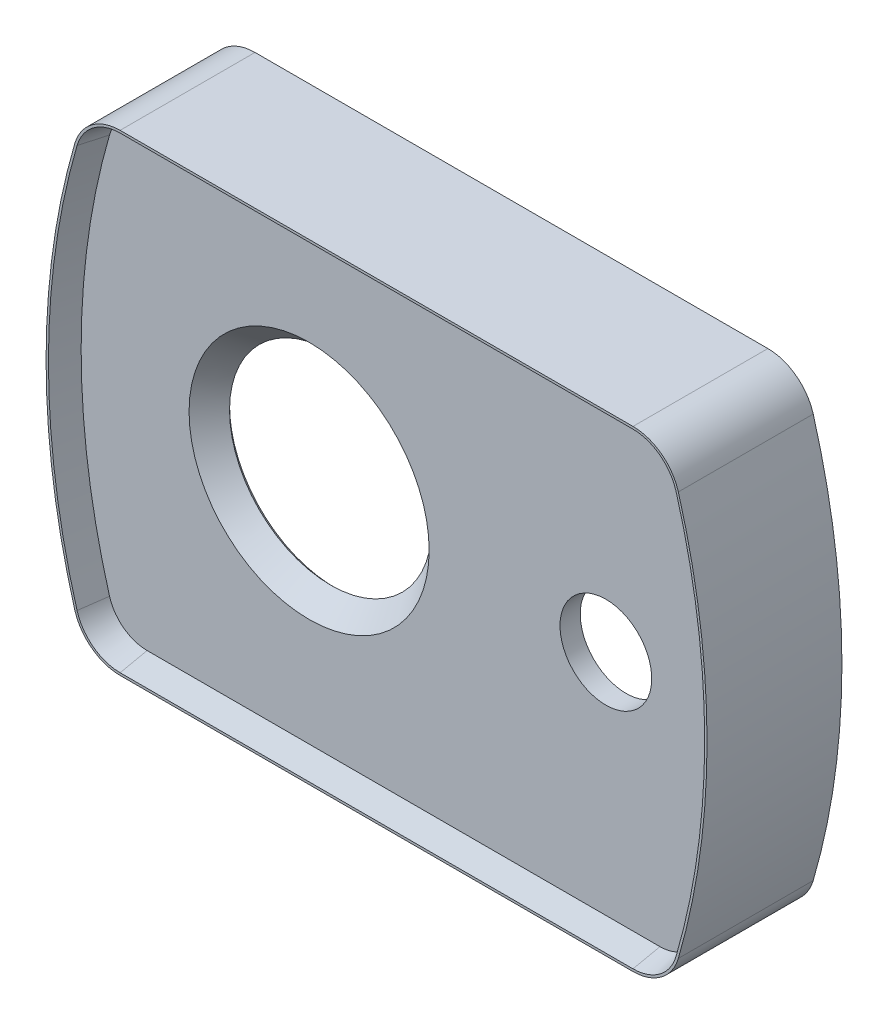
ISO-10303-21;
HEADER;
FILE_DESCRIPTION(('STEP AP214'),'2;1');
FILE_NAME('part.step','',(''),(''),'','','');
FILE_SCHEMA(('AUTOMOTIVE_DESIGN { 1 0 10303 214 1 1 1 1 }'));
ENDSEC;
DATA;
#1=APPLICATION_CONTEXT('core data for automotive mechanical design processes');
#2=APPLICATION_PROTOCOL_DEFINITION('international standard','automotive_design',2000,#1);
#3=PRODUCT_CONTEXT('',#1,'mechanical');
#4=PRODUCT('Part','Part','',(#3));
#5=PRODUCT_RELATED_PRODUCT_CATEGORY('part','',(#4));
#6=PRODUCT_DEFINITION_FORMATION('','',#4);
#7=PRODUCT_DEFINITION_CONTEXT('part definition',#1,'design');
#8=PRODUCT_DEFINITION('design','',#6,#7);
#9=PRODUCT_DEFINITION_SHAPE('','',#8);
#10=(LENGTH_UNIT() NAMED_UNIT(*) SI_UNIT(.MILLI.,.METRE.));
#11=(NAMED_UNIT(*) PLANE_ANGLE_UNIT() SI_UNIT($,.RADIAN.));
#12=(NAMED_UNIT(*) SI_UNIT($,.STERADIAN.) SOLID_ANGLE_UNIT());
#13=UNCERTAINTY_MEASURE_WITH_UNIT(LENGTH_MEASURE(1.E-05),#10,'distance_accuracy_value','');
#14=(GEOMETRIC_REPRESENTATION_CONTEXT(3) GLOBAL_UNCERTAINTY_ASSIGNED_CONTEXT((#13)) GLOBAL_UNIT_ASSIGNED_CONTEXT((#10,
#11,#12)) REPRESENTATION_CONTEXT('',''));
#15=CARTESIAN_POINT('',(0.,0.,0.));
#16=DIRECTION('',(0.,0.,1.));
#17=DIRECTION('',(1.,0.,0.));
#18=AXIS2_PLACEMENT_3D('',#15,#16,#17);
#19=CARTESIAN_POINT('',(0.,0.,3.5));
#20=DIRECTION('',(0.,0.,-1.));
#21=DIRECTION('',(0.,1.,0.));
#22=AXIS2_PLACEMENT_3D('',#19,#20,#21);
#23=CYLINDRICAL_SURFACE('',#22,14.);
#24=CARTESIAN_POINT('',(0.,0.,0.));
#25=DIRECTION('',(0.,0.,1.));
#26=DIRECTION('',(1.,0.,0.));
#27=AXIS2_PLACEMENT_3D('',#24,#25,#26);
#28=CIRCLE('',#27,14.);
#29=CARTESIAN_POINT('',(14.,0.,0.));
#30=VERTEX_POINT('',#29);
#31=EDGE_CURVE('E1402',#30,#30,#28,.F.);
#32=ORIENTED_EDGE('',*,*,#31,.T.);
#33=EDGE_LOOP('',(#32));
#34=FACE_BOUND('',#33,.T.);
#35=CARTESIAN_POINT('',(0.,0.,0.5));
#36=DIRECTION('',(0.,0.,-1.));
#37=DIRECTION('',(0.,1.,0.));
#38=AXIS2_PLACEMENT_3D('',#35,#36,#37);
#39=CIRCLE('',#38,14.);
#40=CARTESIAN_POINT('',(0.,14.,0.5));
#41=VERTEX_POINT('',#40);
#42=EDGE_CURVE('E1387',#41,#41,#39,.T.);
#43=ORIENTED_EDGE('',*,*,#42,.F.);
#44=EDGE_LOOP('',(#43));
#45=FACE_BOUND('',#44,.T.);
#46=ADVANCED_FACE('F14',(#34,#45),#23,.F.);
#47=CARTESIAN_POINT('',(26.0105676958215,13.9999999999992,0.));
#48=DIRECTION('',(0.,0.,1.));
#49=DIRECTION('',(1.,0.,0.));
#50=AXIS2_PLACEMENT_3D('',#47,#48,#49);
#51=PLANE('',#50);
#52=CARTESIAN_POINT('',(26.0105676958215,13.9999999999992,0.));
#53=DIRECTION('',(0.,0.,1.));
#54=DIRECTION('',(1.,0.,0.));
#55=AXIS2_PLACEMENT_3D('',#52,#53,#54);
#56=CIRCLE('',#55,1.70000000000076);
#57=CARTESIAN_POINT('',(27.643270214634,14.473584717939,0.));
#58=VERTEX_POINT('',#57);
#59=CARTESIAN_POINT('',(26.010567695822,15.7,0.));
#60=VERTEX_POINT('',#59);
#61=EDGE_CURVE('E339',#58,#60,#56,.T.);
#62=ORIENTED_EDGE('',*,*,#61,.F.);
#63=CARTESIAN_POINT('',(-22.2549999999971,0.,0.));
#64=DIRECTION('',(0.,0.,1.));
#65=DIRECTION('',(-1.,0.,0.));
#66=AXIS2_PLACEMENT_3D('',#63,#64,#65);
#67=CIRCLE('',#66,51.9549999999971);
#68=CARTESIAN_POINT('',(27.643270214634,-14.473584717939,0.));
#69=VERTEX_POINT('',#68);
#70=EDGE_CURVE('E360',#69,#58,#67,.T.);
#71=ORIENTED_EDGE('',*,*,#70,.F.);
#72=CARTESIAN_POINT('',(26.0105676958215,-13.9999999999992,0.));
#73=DIRECTION('',(0.,0.,1.));
#74=DIRECTION('',(1.,0.,0.));
#75=AXIS2_PLACEMENT_3D('',#72,#73,#74);
#76=CIRCLE('',#75,1.70000000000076);
#77=CARTESIAN_POINT('',(26.010567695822,-15.7,0.));
#78=VERTEX_POINT('',#77);
#79=EDGE_CURVE('E357',#78,#69,#76,.T.);
#80=ORIENTED_EDGE('',*,*,#79,.F.);
#81=DIRECTION('',(1.,0.,0.));
#82=VECTOR('',#81,1.);
#83=CARTESIAN_POINT('',(-12.010567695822,-15.7,0.));
#84=LINE('',#83,#82);
#85=CARTESIAN_POINT('',(-12.010567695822,-15.7,0.));
#86=VERTEX_POINT('',#85);
#87=EDGE_CURVE('E354',#86,#78,#84,.T.);
#88=ORIENTED_EDGE('',*,*,#87,.F.);
#89=CARTESIAN_POINT('',(-12.0105676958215,-13.9999999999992,0.));
#90=DIRECTION('',(0.,0.,1.));
#91=DIRECTION('',(1.,0.,0.));
#92=AXIS2_PLACEMENT_3D('',#89,#90,#91);
#93=CIRCLE('',#92,1.70000000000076);
#94=CARTESIAN_POINT('',(-13.643270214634,-14.4735847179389,0.));
#95=VERTEX_POINT('',#94);
#96=EDGE_CURVE('E351',#95,#86,#93,.T.);
#97=ORIENTED_EDGE('',*,*,#96,.F.);
#98=CARTESIAN_POINT('',(36.2549999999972,0.,0.));
#99=DIRECTION('',(0.,0.,1.));
#100=DIRECTION('',(1.,0.,0.));
#101=AXIS2_PLACEMENT_3D('',#98,#99,#100);
#102=CIRCLE('',#101,51.9549999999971);
#103=CARTESIAN_POINT('',(-13.643270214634,14.473584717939,0.));
#104=VERTEX_POINT('',#103);
#105=EDGE_CURVE('E348',#104,#95,#102,.T.);
#106=ORIENTED_EDGE('',*,*,#105,.F.);
#107=CARTESIAN_POINT('',(-12.0105676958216,13.9999999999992,0.));
#108=DIRECTION('',(0.,0.,1.));
#109=DIRECTION('',(1.,0.,0.));
#110=AXIS2_PLACEMENT_3D('',#107,#108,#109);
#111=CIRCLE('',#110,1.70000000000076);
#112=CARTESIAN_POINT('',(-12.010567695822,15.7,0.));
#113=VERTEX_POINT('',#112);
#114=EDGE_CURVE('E345',#113,#104,#111,.T.);
#115=ORIENTED_EDGE('',*,*,#114,.F.);
#116=DIRECTION('',(-1.,0.,0.));
#117=VECTOR('',#116,1.);
#118=CARTESIAN_POINT('',(26.010567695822,15.7,0.));
#119=LINE('',#118,#117);
#120=EDGE_CURVE('E342',#60,#113,#119,.T.);
#121=ORIENTED_EDGE('',*,*,#120,.F.);
#122=EDGE_LOOP('',(#62,#71,#80,#88,#97,#106,#115,#121));
#123=FACE_BOUND('',#122,.T.);
#124=CARTESIAN_POINT('',(22.,0.,0.));
#125=DIRECTION('',(0.,0.,-1.));
#126=DIRECTION('',(0.,1.,0.));
#127=AXIS2_PLACEMENT_3D('',#124,#125,#126);
#128=CIRCLE('',#127,3.4);
#129=CARTESIAN_POINT('',(22.,3.4,0.));
#130=VERTEX_POINT('',#129);
#131=EDGE_CURVE('E249',#130,#130,#128,.T.);
#132=ORIENTED_EDGE('',*,*,#131,.F.);
#133=EDGE_LOOP('',(#132));
#134=FACE_BOUND('',#133,.T.);
#135=ORIENTED_EDGE('',*,*,#31,.F.);
#136=EDGE_LOOP('',(#135));
#137=FACE_BOUND('',#136,.T.);
#138=ADVANCED_FACE('F559',(#123,#134,#137),#51,.F.);
#139=CARTESIAN_POINT('',(26.0105676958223,14.0000000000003,1.5));
#140=DIRECTION('',(0.,0.,1.));
#141=DIRECTION('',(1.,0.,0.));
#142=AXIS2_PLACEMENT_3D('',#139,#140,#141);
#143=PLANE('',#142);
#144=CARTESIAN_POINT('',(0.,0.,1.5));
#145=DIRECTION('',(0.,0.,-1.));
#146=DIRECTION('',(0.,1.,0.));
#147=AXIS2_PLACEMENT_3D('',#144,#145,#146);
#148=CIRCLE('',#147,8.9);
#149=CARTESIAN_POINT('',(0.,8.9,1.5));
#150=VERTEX_POINT('',#149);
#151=EDGE_CURVE('E1390',#150,#150,#148,.T.);
#152=ORIENTED_EDGE('',*,*,#151,.T.);
#153=EDGE_LOOP('',(#152));
#154=FACE_BOUND('',#153,.T.);
#155=CARTESIAN_POINT('',(22.,0.,1.5));
#156=DIRECTION('',(0.,0.,-1.));
#157=DIRECTION('',(0.,1.,0.));
#158=AXIS2_PLACEMENT_3D('',#155,#156,#157);
#159=CIRCLE('',#158,3.4);
#160=CARTESIAN_POINT('',(22.,3.4,1.5));
#161=VERTEX_POINT('',#160);
#162=EDGE_CURVE('E258',#161,#161,#159,.T.);
#163=ORIENTED_EDGE('',*,*,#162,.T.);
#164=EDGE_LOOP('',(#163));
#165=FACE_BOUND('',#164,.T.);
#166=CARTESIAN_POINT('',(26.0105676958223,14.0000000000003,1.5));
#167=DIRECTION('',(0.,0.,1.));
#168=DIRECTION('',(1.,0.,0.));
#169=AXIS2_PLACEMENT_3D('',#166,#167,#168);
#170=CIRCLE('',#169,2.89988687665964);
#171=CARTESIAN_POINT('',(28.7956574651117,14.8078482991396,1.5));
#172=VERTEX_POINT('',#171);
#173=CARTESIAN_POINT('',(26.0105676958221,16.8998868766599,1.5));
#174=VERTEX_POINT('',#173);
#175=EDGE_CURVE('E230',#172,#174,#170,.T.);
#176=ORIENTED_EDGE('',*,*,#175,.T.);
#177=DIRECTION('',(-1.,0.,0.));
#178=VECTOR('',#177,1.);
#179=CARTESIAN_POINT('',(26.0105676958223,16.8998868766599,1.5));
#180=LINE('',#179,#178);
#181=CARTESIAN_POINT('',(-12.010567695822,16.8998868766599,1.5));
#182=VERTEX_POINT('',#181);
#183=EDGE_CURVE('E308',#174,#182,#180,.T.);
#184=ORIENTED_EDGE('',*,*,#183,.T.);
#185=CARTESIAN_POINT('',(-12.0105676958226,14.0000000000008,1.5));
#186=DIRECTION('',(0.,0.,1.));
#187=DIRECTION('',(1.,0.,0.));
#188=AXIS2_PLACEMENT_3D('',#185,#186,#187);
#189=CIRCLE('',#188,2.89988687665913);
#190=CARTESIAN_POINT('',(-14.795657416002,14.8078484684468,1.5));
#191=VERTEX_POINT('',#190);
#192=EDGE_CURVE('E305',#182,#191,#189,.T.);
#193=ORIENTED_EDGE('',*,*,#192,.T.);
#194=CARTESIAN_POINT('',(36.2549999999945,-2.81892564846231E-13,1.5));
#195=DIRECTION('',(0.,0.,1.));
#196=DIRECTION('',(1.,0.,0.));
#197=AXIS2_PLACEMENT_3D('',#194,#195,#196);
#198=CIRCLE('',#197,53.1548868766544);
#199=CARTESIAN_POINT('',(-14.7956574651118,-14.8078482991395,1.5));
#200=VERTEX_POINT('',#199);
#201=EDGE_CURVE('E302',#191,#200,#198,.T.);
#202=ORIENTED_EDGE('',*,*,#201,.T.);
#203=CARTESIAN_POINT('',(-12.0105676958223,-14.0000000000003,1.5));
#204=DIRECTION('',(0.,0.,1.));
#205=DIRECTION('',(1.,0.,0.));
#206=AXIS2_PLACEMENT_3D('',#203,#204,#205);
#207=CIRCLE('',#206,2.89988687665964);
#208=CARTESIAN_POINT('',(-12.010567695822,-16.8998868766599,1.5));
#209=VERTEX_POINT('',#208);
#210=EDGE_CURVE('E299',#200,#209,#207,.T.);
#211=ORIENTED_EDGE('',*,*,#210,.T.);
#212=DIRECTION('',(1.,0.,0.));
#213=VECTOR('',#212,1.);
#214=CARTESIAN_POINT('',(26.0105676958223,-16.8998868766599,1.5));
#215=LINE('',#214,#213);
#216=CARTESIAN_POINT('',(26.010567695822,-16.8998868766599,1.5));
#217=VERTEX_POINT('',#216);
#218=EDGE_CURVE('E296',#209,#217,#215,.T.);
#219=ORIENTED_EDGE('',*,*,#218,.T.);
#220=CARTESIAN_POINT('',(26.0105676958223,-14.0000000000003,1.5));
#221=DIRECTION('',(0.,0.,1.));
#222=DIRECTION('',(1.,0.,0.));
#223=AXIS2_PLACEMENT_3D('',#220,#221,#222);
#224=CIRCLE('',#223,2.89988687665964);
#225=CARTESIAN_POINT('',(28.7956574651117,-14.8078482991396,1.5));
#226=VERTEX_POINT('',#225);
#227=EDGE_CURVE('E293',#217,#226,#224,.T.);
#228=ORIENTED_EDGE('',*,*,#227,.T.);
#229=CARTESIAN_POINT('',(-22.2549999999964,0.,1.5));
#230=DIRECTION('',(0.,0.,1.));
#231=DIRECTION('',(1.,0.,0.));
#232=AXIS2_PLACEMENT_3D('',#229,#230,#231);
#233=CIRCLE('',#232,53.1548868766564);
#234=EDGE_CURVE('E235',#226,#172,#233,.T.);
#235=ORIENTED_EDGE('',*,*,#234,.T.);
#236=EDGE_LOOP('',(#176,#184,#193,#202,#211,#219,#228,#235));
#237=FACE_BOUND('',#236,.T.);
#238=ADVANCED_FACE('F566',(#154,#165,#237),#143,.T.);
#239=CARTESIAN_POINT('',(26.0105676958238,14.0000000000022,-6.5));
#240=DIRECTION('',(0.,0.,1.));
#241=DIRECTION('',(1.,0.,0.));
#242=AXIS2_PLACEMENT_3D('',#239,#240,#241);
#243=PLANE('',#242);
#244=CARTESIAN_POINT('',(26.0105676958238,14.0000000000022,-6.5));
#245=DIRECTION('',(0.,0.,1.));
#246=DIRECTION('',(1.,0.,0.));
#247=AXIS2_PLACEMENT_3D('',#244,#245,#246);
#248=CIRCLE('',#247,3.49999999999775);
#249=CARTESIAN_POINT('',(29.372014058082,14.975027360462,-6.5));
#250=VERTEX_POINT('',#249);
#251=CARTESIAN_POINT('',(26.010567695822,17.5,-6.5));
#252=VERTEX_POINT('',#251);
#253=EDGE_CURVE('E448',#250,#252,#248,.T.);
#254=ORIENTED_EDGE('',*,*,#253,.F.);
#255=CARTESIAN_POINT('',(-22.2550000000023,-9.20270804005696E-13,-6.5));
#256=DIRECTION('',(0.,0.,1.));
#257=DIRECTION('',(-1.,0.,0.));
#258=AXIS2_PLACEMENT_3D('',#255,#256,#257);
#259=CIRCLE('',#258,53.7550000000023);
#260=CARTESIAN_POINT('',(29.372014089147,-14.975027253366,-6.5));
#261=VERTEX_POINT('',#260);
#262=EDGE_CURVE('E467',#261,#250,#259,.T.);
#263=ORIENTED_EDGE('',*,*,#262,.F.);
#264=CARTESIAN_POINT('',(26.0105676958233,-14.0000000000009,-6.5));
#265=DIRECTION('',(0.,0.,1.));
#266=DIRECTION('',(1.,0.,0.));
#267=AXIS2_PLACEMENT_3D('',#264,#265,#266);
#268=CIRCLE('',#267,3.49999999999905);
#269=CARTESIAN_POINT('',(26.010567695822,-17.5,-6.5));
#270=VERTEX_POINT('',#269);
#271=EDGE_CURVE('E464',#270,#261,#268,.T.);
#272=ORIENTED_EDGE('',*,*,#271,.F.);
#273=DIRECTION('',(1.,0.,0.));
#274=VECTOR('',#273,1.);
#275=CARTESIAN_POINT('',(-12.010567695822,-17.5,-6.5));
#276=LINE('',#275,#274);
#277=CARTESIAN_POINT('',(-12.010567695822,-17.5,-6.5));
#278=VERTEX_POINT('',#277);
#279=EDGE_CURVE('E461',#278,#270,#276,.T.);
#280=ORIENTED_EDGE('',*,*,#279,.F.);
#281=CARTESIAN_POINT('',(-12.0105676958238,-14.0000000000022,-6.5));
#282=DIRECTION('',(0.,0.,1.));
#283=DIRECTION('',(1.,0.,0.));
#284=AXIS2_PLACEMENT_3D('',#281,#282,#283);
#285=CIRCLE('',#284,3.49999999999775);
#286=CARTESIAN_POINT('',(-15.372014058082,-14.975027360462,-6.5));
#287=VERTEX_POINT('',#286);
#288=EDGE_CURVE('E458',#287,#278,#285,.T.);
#289=ORIENTED_EDGE('',*,*,#288,.F.);
#290=CARTESIAN_POINT('',(36.2550000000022,9.2374025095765E-13,-6.5));
#291=DIRECTION('',(0.,0.,1.));
#292=DIRECTION('',(1.,0.,0.));
#293=AXIS2_PLACEMENT_3D('',#290,#291,#292);
#294=CIRCLE('',#293,53.7550000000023);
#295=CARTESIAN_POINT('',(-15.372014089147,14.975027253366,-6.5));
#296=VERTEX_POINT('',#295);
#297=EDGE_CURVE('E455',#296,#287,#294,.T.);
#298=ORIENTED_EDGE('',*,*,#297,.F.);
#299=CARTESIAN_POINT('',(-12.0105676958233,14.000000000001,-6.5));
#300=DIRECTION('',(0.,0.,1.));
#301=DIRECTION('',(1.,0.,0.));
#302=AXIS2_PLACEMENT_3D('',#299,#300,#301);
#303=CIRCLE('',#302,3.49999999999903);
#304=CARTESIAN_POINT('',(-12.010567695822,17.5,-6.5));
#305=VERTEX_POINT('',#304);
#306=EDGE_CURVE('E452',#305,#296,#303,.T.);
#307=ORIENTED_EDGE('',*,*,#306,.F.);
#308=DIRECTION('',(-1.,0.,0.));
#309=VECTOR('',#308,1.);
#310=CARTESIAN_POINT('',(26.010567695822,17.5,-6.5));
#311=LINE('',#310,#309);
#312=EDGE_CURVE('E449',#252,#305,#311,.T.);
#313=ORIENTED_EDGE('',*,*,#312,.F.);
#314=EDGE_LOOP('',(#254,#263,#272,#280,#289,#298,#307,#313));
#315=FACE_BOUND('',#314,.T.);
#316=CARTESIAN_POINT('',(26.0105676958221,14.0000000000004,-6.5));
#317=DIRECTION('',(0.,0.,1.));
#318=DIRECTION('',(1.,0.,0.));
#319=AXIS2_PLACEMENT_3D('',#316,#317,#318);
#320=CIRCLE('',#319,2.49999999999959);
#321=CARTESIAN_POINT('',(28.411600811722,14.696448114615,-6.5));
#322=VERTEX_POINT('',#321);
#323=CARTESIAN_POINT('',(26.010567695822,16.5,-6.5));
#324=VERTEX_POINT('',#323);
#325=EDGE_CURVE('E381',#322,#324,#320,.T.);
#326=ORIENTED_EDGE('',*,*,#325,.T.);
#327=DIRECTION('',(-1.,0.,0.));
#328=VECTOR('',#327,1.);
#329=CARTESIAN_POINT('',(26.010567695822,16.5,-6.5));
#330=LINE('',#329,#328);
#331=CARTESIAN_POINT('',(-12.010567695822,16.5,-6.5));
#332=VERTEX_POINT('',#331);
#333=EDGE_CURVE('E382',#324,#332,#330,.T.);
#334=ORIENTED_EDGE('',*,*,#333,.T.);
#335=CARTESIAN_POINT('',(-12.0105676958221,14.0000000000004,-6.5));
#336=DIRECTION('',(0.,0.,1.));
#337=DIRECTION('',(1.,0.,0.));
#338=AXIS2_PLACEMENT_3D('',#335,#336,#337);
#339=CIRCLE('',#338,2.49999999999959);
#340=CARTESIAN_POINT('',(-14.411600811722,14.696448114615,-6.5));
#341=VERTEX_POINT('',#340);
#342=EDGE_CURVE('E386',#332,#341,#339,.T.);
#343=ORIENTED_EDGE('',*,*,#342,.T.);
#344=CARTESIAN_POINT('',(36.2549999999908,0.,-6.5));
#345=DIRECTION('',(0.,0.,1.));
#346=DIRECTION('',(1.,0.,0.));
#347=AXIS2_PLACEMENT_3D('',#344,#345,#346);
#348=CIRCLE('',#347,52.7549999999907);
#349=CARTESIAN_POINT('',(-14.411600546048,-14.6964490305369,-6.5));
#350=VERTEX_POINT('',#349);
#351=EDGE_CURVE('E390',#341,#350,#348,.T.);
#352=ORIENTED_EDGE('',*,*,#351,.T.);
#353=CARTESIAN_POINT('',(-12.010567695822,-13.9999999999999,-6.5));
#354=DIRECTION('',(0.,0.,1.));
#355=DIRECTION('',(1.,0.,0.));
#356=AXIS2_PLACEMENT_3D('',#353,#354,#355);
#357=CIRCLE('',#356,2.50000000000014);
#358=CARTESIAN_POINT('',(-12.010567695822,-16.5,-6.5));
#359=VERTEX_POINT('',#358);
#360=EDGE_CURVE('E394',#350,#359,#357,.T.);
#361=ORIENTED_EDGE('',*,*,#360,.T.);
#362=DIRECTION('',(1.,0.,0.));
#363=VECTOR('',#362,1.);
#364=CARTESIAN_POINT('',(-12.010567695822,-16.5,-6.5));
#365=LINE('',#364,#363);
#366=CARTESIAN_POINT('',(26.010567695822,-16.5,-6.5));
#367=VERTEX_POINT('',#366);
#368=EDGE_CURVE('E398',#359,#367,#365,.T.);
#369=ORIENTED_EDGE('',*,*,#368,.T.);
#370=CARTESIAN_POINT('',(26.0105676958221,-14.0000000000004,-6.5));
#371=DIRECTION('',(0.,0.,1.));
#372=DIRECTION('',(1.,0.,0.));
#373=AXIS2_PLACEMENT_3D('',#370,#371,#372);
#374=CIRCLE('',#373,2.49999999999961);
#375=CARTESIAN_POINT('',(28.411600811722,-14.696448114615,-6.5));
#376=VERTEX_POINT('',#375);
#377=EDGE_CURVE('E402',#367,#376,#374,.T.);
#378=ORIENTED_EDGE('',*,*,#377,.T.);
#379=CARTESIAN_POINT('',(-22.2549999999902,0.,-6.5));
#380=DIRECTION('',(0.,0.,1.));
#381=DIRECTION('',(-1.,0.,0.));
#382=AXIS2_PLACEMENT_3D('',#379,#380,#381);
#383=CIRCLE('',#382,52.7549999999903);
#384=EDGE_CURVE('E406',#376,#322,#383,.T.);
#385=ORIENTED_EDGE('',*,*,#384,.T.);
#386=EDGE_LOOP('',(#326,#334,#343,#352,#361,#369,#378,#385));
#387=FACE_BOUND('',#386,.T.);
#388=ADVANCED_FACE('F518',(#315,#387),#243,.F.);
#389=CARTESIAN_POINT('',(26.0105676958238,14.0000000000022,3.5));
#390=DIRECTION('',(0.,0.,-1.));
#391=DIRECTION('',(0.,1.,0.));
#392=AXIS2_PLACEMENT_3D('',#389,#390,#391);
#393=CYLINDRICAL_SURFACE('',#392,3.49999999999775);
#394=ORIENTED_EDGE('',*,*,#253,.T.);
#395=DIRECTION('',(0.,0.,-1.));
#396=VECTOR('',#395,1.);
#397=CARTESIAN_POINT('',(26.010567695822,17.5,3.5));
#398=LINE('',#397,#396);
#399=CARTESIAN_POINT('',(26.010567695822,17.5,3.5));
#400=VERTEX_POINT('',#399);
#401=EDGE_CURVE('E9',#400,#252,#398,.T.);
#402=ORIENTED_EDGE('',*,*,#401,.F.);
#403=CARTESIAN_POINT('',(26.0105676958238,14.0000000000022,3.5));
#404=DIRECTION('',(0.,0.,1.));
#405=DIRECTION('',(1.,0.,0.));
#406=AXIS2_PLACEMENT_3D('',#403,#404,#405);
#407=CIRCLE('',#406,3.49999999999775);
#408=CARTESIAN_POINT('',(29.372014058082,14.975027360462,3.5));
#409=VERTEX_POINT('',#408);
#410=EDGE_CURVE('E470',#409,#400,#407,.T.);
#411=ORIENTED_EDGE('',*,*,#410,.F.);
#412=DIRECTION('',(0.,0.,-1.));
#413=VECTOR('',#412,1.);
#414=CARTESIAN_POINT('',(29.372014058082,14.975027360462,3.5));
#415=LINE('',#414,#413);
#416=EDGE_CURVE('E488',#409,#250,#415,.T.);
#417=ORIENTED_EDGE('',*,*,#416,.T.);
#418=EDGE_LOOP('',(#394,#402,#411,#417));
#419=FACE_BOUND('',#418,.T.);
#420=ADVANCED_FACE('F16',(#419),#393,.T.);
#421=CARTESIAN_POINT('',(26.010567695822,17.5,3.5));
#422=DIRECTION('',(0.,-1.,0.));
#423=DIRECTION('',(0.,0.,-1.));
#424=AXIS2_PLACEMENT_3D('',#421,#422,#423);
#425=PLANE('',#424);
#426=ORIENTED_EDGE('',*,*,#312,.T.);
#427=DIRECTION('',(0.,0.,-1.));
#428=VECTOR('',#427,1.);
#429=CARTESIAN_POINT('',(-12.010567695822,17.5,3.5));
#430=LINE('',#429,#428);
#431=CARTESIAN_POINT('',(-12.010567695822,17.5,3.5));
#432=VERTEX_POINT('',#431);
#433=EDGE_CURVE('E22',#432,#305,#430,.T.);
#434=ORIENTED_EDGE('',*,*,#433,.F.);
#435=DIRECTION('',(-1.,0.,0.));
#436=VECTOR('',#435,1.);
#437=CARTESIAN_POINT('',(26.010567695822,17.5,3.5));
#438=LINE('',#437,#436);
#439=EDGE_CURVE('E474',#400,#432,#438,.T.);
#440=ORIENTED_EDGE('',*,*,#439,.F.);
#441=ORIENTED_EDGE('',*,*,#401,.T.);
#442=EDGE_LOOP('',(#426,#434,#440,#441));
#443=FACE_BOUND('',#442,.T.);
#444=ADVANCED_FACE('F534',(#443),#425,.F.);
#445=CARTESIAN_POINT('',(-12.0105676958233,14.000000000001,3.5));
#446=DIRECTION('',(0.,0.,-1.));
#447=DIRECTION('',(0.,1.,0.));
#448=AXIS2_PLACEMENT_3D('',#445,#446,#447);
#449=CYLINDRICAL_SURFACE('',#448,3.49999999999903);
#450=ORIENTED_EDGE('',*,*,#306,.T.);
#451=DIRECTION('',(0.,0.,-1.));
#452=VECTOR('',#451,1.);
#453=CARTESIAN_POINT('',(-15.372014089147,14.975027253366,3.5));
#454=LINE('',#453,#452);
#455=CARTESIAN_POINT('',(-15.372014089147,14.975027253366,3.5));
#456=VERTEX_POINT('',#455);
#457=EDGE_CURVE('E505',#456,#296,#454,.T.);
#458=ORIENTED_EDGE('',*,*,#457,.F.);
#459=CARTESIAN_POINT('',(-12.0105676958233,14.000000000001,3.5));
#460=DIRECTION('',(0.,0.,1.));
#461=DIRECTION('',(1.,0.,0.));
#462=AXIS2_PLACEMENT_3D('',#459,#460,#461);
#463=CIRCLE('',#462,3.49999999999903);
#464=EDGE_CURVE('E476',#432,#456,#463,.T.);
#465=ORIENTED_EDGE('',*,*,#464,.F.);
#466=ORIENTED_EDGE('',*,*,#433,.T.);
#467=EDGE_LOOP('',(#450,#458,#465,#466));
#468=FACE_BOUND('',#467,.T.);
#469=ADVANCED_FACE('F512',(#468),#449,.T.);
#470=CARTESIAN_POINT('',(36.2550000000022,9.2374025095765E-13,3.5));
#471=DIRECTION('',(0.,0.,-1.));
#472=DIRECTION('',(0.,1.,0.));
#473=AXIS2_PLACEMENT_3D('',#470,#471,#472);
#474=CYLINDRICAL_SURFACE('',#473,53.7550000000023);
#475=ORIENTED_EDGE('',*,*,#297,.T.);
#476=DIRECTION('',(0.,0.,-1.));
#477=VECTOR('',#476,1.);
#478=CARTESIAN_POINT('',(-15.372014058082,-14.975027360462,3.5));
#479=LINE('',#478,#477);
#480=CARTESIAN_POINT('',(-15.372014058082,-14.975027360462,3.5));
#481=VERTEX_POINT('',#480);
#482=EDGE_CURVE('E502',#481,#287,#479,.T.);
#483=ORIENTED_EDGE('',*,*,#482,.F.);
#484=CARTESIAN_POINT('',(36.2550000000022,9.2374025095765E-13,3.5));
#485=DIRECTION('',(0.,0.,1.));
#486=DIRECTION('',(1.,0.,0.));
#487=AXIS2_PLACEMENT_3D('',#484,#485,#486);
#488=CIRCLE('',#487,53.7550000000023);
#489=EDGE_CURVE('E478',#456,#481,#488,.T.);
#490=ORIENTED_EDGE('',*,*,#489,.F.);
#491=ORIENTED_EDGE('',*,*,#457,.T.);
#492=EDGE_LOOP('',(#475,#483,#490,#491));
#493=FACE_BOUND('',#492,.T.);
#494=ADVANCED_FACE('F524',(#493),#474,.T.);
#495=CARTESIAN_POINT('',(-12.0105676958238,-14.0000000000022,3.5));
#496=DIRECTION('',(0.,0.,-1.));
#497=DIRECTION('',(0.,1.,0.));
#498=AXIS2_PLACEMENT_3D('',#495,#496,#497);
#499=CYLINDRICAL_SURFACE('',#498,3.49999999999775);
#500=ORIENTED_EDGE('',*,*,#288,.T.);
#501=DIRECTION('',(0.,0.,-1.));
#502=VECTOR('',#501,1.);
#503=CARTESIAN_POINT('',(-12.010567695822,-17.5,3.5));
#504=LINE('',#503,#502);
#505=CARTESIAN_POINT('',(-12.010567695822,-17.5,3.5));
#506=VERTEX_POINT('',#505);
#507=EDGE_CURVE('E499',#506,#278,#504,.T.);
#508=ORIENTED_EDGE('',*,*,#507,.F.);
#509=CARTESIAN_POINT('',(-12.0105676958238,-14.0000000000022,3.5));
#510=DIRECTION('',(0.,0.,1.));
#511=DIRECTION('',(1.,0.,0.));
#512=AXIS2_PLACEMENT_3D('',#509,#510,#511);
#513=CIRCLE('',#512,3.49999999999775);
#514=EDGE_CURVE('E480',#481,#506,#513,.T.);
#515=ORIENTED_EDGE('',*,*,#514,.F.);
#516=ORIENTED_EDGE('',*,*,#482,.T.);
#517=EDGE_LOOP('',(#500,#508,#515,#516));
#518=FACE_BOUND('',#517,.T.);
#519=ADVANCED_FACE('F528',(#518),#499,.T.);
#520=CARTESIAN_POINT('',(-12.010567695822,-17.5,3.5));
#521=DIRECTION('',(0.,1.,0.));
#522=DIRECTION('',(0.,0.,1.));
#523=AXIS2_PLACEMENT_3D('',#520,#521,#522);
#524=PLANE('',#523);
#525=ORIENTED_EDGE('',*,*,#279,.T.);
#526=DIRECTION('',(0.,0.,-1.));
#527=VECTOR('',#526,1.);
#528=CARTESIAN_POINT('',(26.010567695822,-17.5,3.5));
#529=LINE('',#528,#527);
#530=CARTESIAN_POINT('',(26.010567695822,-17.5,3.5));
#531=VERTEX_POINT('',#530);
#532=EDGE_CURVE('E496',#531,#270,#529,.T.);
#533=ORIENTED_EDGE('',*,*,#532,.F.);
#534=DIRECTION('',(1.,0.,0.));
#535=VECTOR('',#534,1.);
#536=CARTESIAN_POINT('',(-12.010567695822,-17.5,3.5));
#537=LINE('',#536,#535);
#538=EDGE_CURVE('E482',#506,#531,#537,.T.);
#539=ORIENTED_EDGE('',*,*,#538,.F.);
#540=ORIENTED_EDGE('',*,*,#507,.T.);
#541=EDGE_LOOP('',(#525,#533,#539,#540));
#542=FACE_BOUND('',#541,.T.);
#543=ADVANCED_FACE('F547',(#542),#524,.F.);
#544=CARTESIAN_POINT('',(26.0105676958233,-14.0000000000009,3.5));
#545=DIRECTION('',(0.,0.,-1.));
#546=DIRECTION('',(0.,1.,0.));
#547=AXIS2_PLACEMENT_3D('',#544,#545,#546);
#548=CYLINDRICAL_SURFACE('',#547,3.49999999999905);
#549=ORIENTED_EDGE('',*,*,#271,.T.);
#550=DIRECTION('',(0.,0.,-1.));
#551=VECTOR('',#550,1.);
#552=CARTESIAN_POINT('',(29.372014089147,-14.975027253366,3.5));
#553=LINE('',#552,#551);
#554=CARTESIAN_POINT('',(29.372014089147,-14.975027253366,3.5));
#555=VERTEX_POINT('',#554);
#556=EDGE_CURVE('E493',#555,#261,#553,.T.);
#557=ORIENTED_EDGE('',*,*,#556,.F.);
#558=CARTESIAN_POINT('',(26.0105676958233,-14.0000000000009,3.5));
#559=DIRECTION('',(0.,0.,1.));
#560=DIRECTION('',(1.,0.,0.));
#561=AXIS2_PLACEMENT_3D('',#558,#559,#560);
#562=CIRCLE('',#561,3.49999999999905);
#563=EDGE_CURVE('E484',#531,#555,#562,.T.);
#564=ORIENTED_EDGE('',*,*,#563,.F.);
#565=ORIENTED_EDGE('',*,*,#532,.T.);
#566=EDGE_LOOP('',(#549,#557,#564,#565));
#567=FACE_BOUND('',#566,.T.);
#568=ADVANCED_FACE('F545',(#567),#548,.T.);
#569=CARTESIAN_POINT('',(-22.2550000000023,-9.20270804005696E-13,3.5));
#570=DIRECTION('',(0.,0.,-1.));
#571=DIRECTION('',(0.,1.,0.));
#572=AXIS2_PLACEMENT_3D('',#569,#570,#571);
#573=CYLINDRICAL_SURFACE('',#572,53.7550000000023);
#574=ORIENTED_EDGE('',*,*,#262,.T.);
#575=ORIENTED_EDGE('',*,*,#416,.F.);
#576=CARTESIAN_POINT('',(-22.2550000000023,-9.20270804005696E-13,3.5));
#577=DIRECTION('',(0.,0.,1.));
#578=DIRECTION('',(-1.,0.,0.));
#579=AXIS2_PLACEMENT_3D('',#576,#577,#578);
#580=CIRCLE('',#579,53.7550000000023);
#581=EDGE_CURVE('E486',#555,#409,#580,.T.);
#582=ORIENTED_EDGE('',*,*,#581,.F.);
#583=ORIENTED_EDGE('',*,*,#556,.T.);
#584=EDGE_LOOP('',(#574,#575,#582,#583));
#585=FACE_BOUND('',#584,.T.);
#586=ADVANCED_FACE('F540',(#585),#573,.T.);
#587=CARTESIAN_POINT('',(26.0105676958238,14.0000000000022,3.5));
#588=DIRECTION('',(0.,0.,1.));
#589=DIRECTION('',(1.,0.,0.));
#590=AXIS2_PLACEMENT_3D('',#587,#588,#589);
#591=PLANE('',#590);
#592=CARTESIAN_POINT('',(26.0105676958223,14.0000000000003,3.5));
#593=DIRECTION('',(0.,0.,1.));
#594=DIRECTION('',(1.,0.,0.));
#595=AXIS2_PLACEMENT_3D('',#592,#593,#594);
#596=CIRCLE('',#595,3.32499999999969);
#597=CARTESIAN_POINT('',(29.203941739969,14.926275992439,3.5));
#598=VERTEX_POINT('',#597);
#599=CARTESIAN_POINT('',(26.010567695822,17.325,3.5));
#600=VERTEX_POINT('',#599);
#601=EDGE_CURVE('E227',#598,#600,#596,.T.);
#602=ORIENTED_EDGE('',*,*,#601,.F.);
#603=CARTESIAN_POINT('',(-22.2549999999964,0.,3.5));
#604=DIRECTION('',(0.,0.,1.));
#605=DIRECTION('',(-1.,0.,0.));
#606=AXIS2_PLACEMENT_3D('',#603,#604,#605);
#607=CIRCLE('',#606,53.5799999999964);
#608=CARTESIAN_POINT('',(29.203941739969,-14.926275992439,3.5));
#609=VERTEX_POINT('',#608);
#610=EDGE_CURVE('E238',#609,#598,#607,.T.);
#611=ORIENTED_EDGE('',*,*,#610,.F.);
#612=CARTESIAN_POINT('',(26.0105676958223,-14.0000000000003,3.5));
#613=DIRECTION('',(0.,0.,1.));
#614=DIRECTION('',(1.,0.,0.));
#615=AXIS2_PLACEMENT_3D('',#612,#613,#614);
#616=CIRCLE('',#615,3.32499999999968);
#617=CARTESIAN_POINT('',(26.010567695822,-17.325,3.5));
#618=VERTEX_POINT('',#617);
#619=EDGE_CURVE('E29',#618,#609,#616,.T.);
#620=ORIENTED_EDGE('',*,*,#619,.F.);
#621=DIRECTION('',(1.,0.,0.));
#622=VECTOR('',#621,1.);
#623=CARTESIAN_POINT('',(26.0105676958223,-17.325,3.5));
#624=LINE('',#623,#622);
#625=CARTESIAN_POINT('',(-12.010567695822,-17.325,3.5));
#626=VERTEX_POINT('',#625);
#627=EDGE_CURVE('E272',#626,#618,#624,.T.);
#628=ORIENTED_EDGE('',*,*,#627,.F.);
#629=CARTESIAN_POINT('',(-12.0105676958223,-14.0000000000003,3.5));
#630=DIRECTION('',(0.,0.,1.));
#631=DIRECTION('',(1.,0.,0.));
#632=AXIS2_PLACEMENT_3D('',#629,#630,#631);
#633=CIRCLE('',#632,3.32499999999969);
#634=CARTESIAN_POINT('',(-15.203941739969,-14.9262759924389,3.5));
#635=VERTEX_POINT('',#634);
#636=EDGE_CURVE('E269',#635,#626,#633,.T.);
#637=ORIENTED_EDGE('',*,*,#636,.F.);
#638=CARTESIAN_POINT('',(36.2549999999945,-2.81892564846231E-13,3.5));
#639=DIRECTION('',(0.,0.,1.));
#640=DIRECTION('',(1.,0.,0.));
#641=AXIS2_PLACEMENT_3D('',#638,#639,#640);
#642=CIRCLE('',#641,53.5799999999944);
#643=CARTESIAN_POINT('',(-15.20394168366,14.926276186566,3.5));
#644=VERTEX_POINT('',#643);
#645=EDGE_CURVE('E265',#644,#635,#642,.T.);
#646=ORIENTED_EDGE('',*,*,#645,.F.);
#647=CARTESIAN_POINT('',(-12.0105676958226,14.0000000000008,3.5));
#648=DIRECTION('',(0.,0.,1.));
#649=DIRECTION('',(1.,0.,0.));
#650=AXIS2_PLACEMENT_3D('',#647,#648,#649);
#651=CIRCLE('',#650,3.32499999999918);
#652=CARTESIAN_POINT('',(-12.010567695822,17.325,3.5));
#653=VERTEX_POINT('',#652);
#654=EDGE_CURVE('E255',#653,#644,#651,.T.);
#655=ORIENTED_EDGE('',*,*,#654,.F.);
#656=DIRECTION('',(-1.,0.,0.));
#657=VECTOR('',#656,1.);
#658=CARTESIAN_POINT('',(26.0105676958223,17.325,3.5));
#659=LINE('',#658,#657);
#660=EDGE_CURVE('E247',#600,#653,#659,.T.);
#661=ORIENTED_EDGE('',*,*,#660,.F.);
#662=EDGE_LOOP('',(#602,#611,#620,#628,#637,#646,#655,#661));
#663=FACE_BOUND('',#662,.T.);
#664=ORIENTED_EDGE('',*,*,#410,.T.);
#665=ORIENTED_EDGE('',*,*,#439,.T.);
#666=ORIENTED_EDGE('',*,*,#464,.T.);
#667=ORIENTED_EDGE('',*,*,#489,.T.);
#668=ORIENTED_EDGE('',*,*,#514,.T.);
#669=ORIENTED_EDGE('',*,*,#538,.T.);
#670=ORIENTED_EDGE('',*,*,#563,.T.);
#671=ORIENTED_EDGE('',*,*,#581,.T.);
#672=EDGE_LOOP('',(#664,#665,#666,#667,#668,#669,#670,#671));
#673=FACE_BOUND('',#672,.T.);
#674=ADVANCED_FACE('F243',(#663,#673),#591,.T.);
#675=CARTESIAN_POINT('',(26.0105676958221,14.0000000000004,0.5));
#676=DIRECTION('',(0.,0.,-1.));
#677=DIRECTION('',(0.,1.,0.));
#678=AXIS2_PLACEMENT_3D('',#675,#676,#677);
#679=CYLINDRICAL_SURFACE('',#678,2.49999999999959);
#680=ORIENTED_EDGE('',*,*,#325,.F.);
#681=DIRECTION('',(0.,0.,-1.));
#682=VECTOR('',#681,1.);
#683=CARTESIAN_POINT('',(28.411600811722,14.696448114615,0.5));
#684=LINE('',#683,#682);
#685=CARTESIAN_POINT('',(28.411600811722,14.696448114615,0.5));
#686=VERTEX_POINT('',#685);
#687=EDGE_CURVE('E428',#686,#322,#684,.T.);
#688=ORIENTED_EDGE('',*,*,#687,.F.);
#689=CARTESIAN_POINT('',(26.0105676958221,14.0000000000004,0.5));
#690=DIRECTION('',(0.,0.,1.));
#691=DIRECTION('',(1.,0.,0.));
#692=AXIS2_PLACEMENT_3D('',#689,#690,#691);
#693=CIRCLE('',#692,2.49999999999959);
#694=CARTESIAN_POINT('',(26.010567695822,16.5,0.5));
#695=VERTEX_POINT('',#694);
#696=EDGE_CURVE('E410',#686,#695,#693,.T.);
#697=ORIENTED_EDGE('',*,*,#696,.T.);
#698=DIRECTION('',(0.,0.,-1.));
#699=VECTOR('',#698,1.);
#700=CARTESIAN_POINT('',(26.010567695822,16.5,0.5));
#701=LINE('',#700,#699);
#702=EDGE_CURVE('E445',#695,#324,#701,.T.);
#703=ORIENTED_EDGE('',*,*,#702,.T.);
#704=EDGE_LOOP('',(#680,#688,#697,#703));
#705=FACE_BOUND('',#704,.T.);
#706=ADVANCED_FACE('F671',(#705),#679,.F.);
#707=CARTESIAN_POINT('',(26.010567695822,16.5,0.5));
#708=DIRECTION('',(0.,-1.,0.));
#709=DIRECTION('',(0.,0.,-1.));
#710=AXIS2_PLACEMENT_3D('',#707,#708,#709);
#711=PLANE('',#710);
#712=ORIENTED_EDGE('',*,*,#333,.F.);
#713=ORIENTED_EDGE('',*,*,#702,.F.);
#714=DIRECTION('',(-1.,0.,0.));
#715=VECTOR('',#714,1.);
#716=CARTESIAN_POINT('',(26.010567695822,16.5,0.5));
#717=LINE('',#716,#715);
#718=CARTESIAN_POINT('',(-12.010567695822,16.5,0.5));
#719=VERTEX_POINT('',#718);
#720=EDGE_CURVE('E414',#695,#719,#717,.T.);
#721=ORIENTED_EDGE('',*,*,#720,.T.);
#722=DIRECTION('',(0.,0.,-1.));
#723=VECTOR('',#722,1.);
#724=CARTESIAN_POINT('',(-12.010567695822,16.5,0.5));
#725=LINE('',#724,#723);
#726=EDGE_CURVE('E443',#719,#332,#725,.T.);
#727=ORIENTED_EDGE('',*,*,#726,.T.);
#728=EDGE_LOOP('',(#712,#713,#721,#727));
#729=FACE_BOUND('',#728,.T.);
#730=ADVANCED_FACE('F667',(#729),#711,.T.);
#731=CARTESIAN_POINT('',(-12.0105676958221,14.0000000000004,0.5));
#732=DIRECTION('',(0.,0.,-1.));
#733=DIRECTION('',(0.,1.,0.));
#734=AXIS2_PLACEMENT_3D('',#731,#732,#733);
#735=CYLINDRICAL_SURFACE('',#734,2.49999999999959);
#736=ORIENTED_EDGE('',*,*,#342,.F.);
#737=ORIENTED_EDGE('',*,*,#726,.F.);
#738=CARTESIAN_POINT('',(-12.0105676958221,14.0000000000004,0.5));
#739=DIRECTION('',(0.,0.,1.));
#740=DIRECTION('',(1.,0.,0.));
#741=AXIS2_PLACEMENT_3D('',#738,#739,#740);
#742=CIRCLE('',#741,2.49999999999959);
#743=CARTESIAN_POINT('',(-14.411600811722,14.696448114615,0.5));
#744=VERTEX_POINT('',#743);
#745=EDGE_CURVE('E416',#719,#744,#742,.T.);
#746=ORIENTED_EDGE('',*,*,#745,.T.);
#747=DIRECTION('',(0.,0.,-1.));
#748=VECTOR('',#747,1.);
#749=CARTESIAN_POINT('',(-14.411600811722,14.696448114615,0.5));
#750=LINE('',#749,#748);
#751=EDGE_CURVE('E441',#744,#341,#750,.T.);
#752=ORIENTED_EDGE('',*,*,#751,.T.);
#753=EDGE_LOOP('',(#736,#737,#746,#752));
#754=FACE_BOUND('',#753,.T.);
#755=ADVANCED_FACE('F663',(#754),#735,.F.);
#756=CARTESIAN_POINT('',(36.2549999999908,0.,0.5));
#757=DIRECTION('',(0.,0.,-1.));
#758=DIRECTION('',(0.,1.,0.));
#759=AXIS2_PLACEMENT_3D('',#756,#757,#758);
#760=CYLINDRICAL_SURFACE('',#759,52.7549999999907);
#761=ORIENTED_EDGE('',*,*,#351,.F.);
#762=ORIENTED_EDGE('',*,*,#751,.F.);
#763=CARTESIAN_POINT('',(36.2549999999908,0.,0.5));
#764=DIRECTION('',(0.,0.,1.));
#765=DIRECTION('',(1.,0.,0.));
#766=AXIS2_PLACEMENT_3D('',#763,#764,#765);
#767=CIRCLE('',#766,52.7549999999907);
#768=CARTESIAN_POINT('',(-14.411600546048,-14.6964490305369,0.5));
#769=VERTEX_POINT('',#768);
#770=EDGE_CURVE('E418',#744,#769,#767,.T.);
#771=ORIENTED_EDGE('',*,*,#770,.T.);
#772=DIRECTION('',(0.,0.,-1.));
#773=VECTOR('',#772,1.);
#774=CARTESIAN_POINT('',(-14.411600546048,-14.6964490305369,0.5));
#775=LINE('',#774,#773);
#776=EDGE_CURVE('E439',#769,#350,#775,.T.);
#777=ORIENTED_EDGE('',*,*,#776,.T.);
#778=EDGE_LOOP('',(#761,#762,#771,#777));
#779=FACE_BOUND('',#778,.T.);
#780=ADVANCED_FACE('F659',(#779),#760,.F.);
#781=CARTESIAN_POINT('',(-12.010567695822,-13.9999999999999,0.5));
#782=DIRECTION('',(0.,0.,-1.));
#783=DIRECTION('',(0.,1.,0.));
#784=AXIS2_PLACEMENT_3D('',#781,#782,#783);
#785=CYLINDRICAL_SURFACE('',#784,2.50000000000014);
#786=ORIENTED_EDGE('',*,*,#360,.F.);
#787=ORIENTED_EDGE('',*,*,#776,.F.);
#788=CARTESIAN_POINT('',(-12.010567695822,-13.9999999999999,0.5));
#789=DIRECTION('',(0.,0.,1.));
#790=DIRECTION('',(1.,0.,0.));
#791=AXIS2_PLACEMENT_3D('',#788,#789,#790);
#792=CIRCLE('',#791,2.50000000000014);
#793=CARTESIAN_POINT('',(-12.010567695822,-16.5,0.5));
#794=VERTEX_POINT('',#793);
#795=EDGE_CURVE('E420',#769,#794,#792,.T.);
#796=ORIENTED_EDGE('',*,*,#795,.T.);
#797=DIRECTION('',(0.,0.,-1.));
#798=VECTOR('',#797,1.);
#799=CARTESIAN_POINT('',(-12.010567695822,-16.5,0.5));
#800=LINE('',#799,#798);
#801=EDGE_CURVE('E437',#794,#359,#800,.T.);
#802=ORIENTED_EDGE('',*,*,#801,.T.);
#803=EDGE_LOOP('',(#786,#787,#796,#802));
#804=FACE_BOUND('',#803,.T.);
#805=ADVANCED_FACE('F655',(#804),#785,.F.);
#806=CARTESIAN_POINT('',(-12.010567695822,-16.5,0.5));
#807=DIRECTION('',(0.,1.,0.));
#808=DIRECTION('',(0.,0.,1.));
#809=AXIS2_PLACEMENT_3D('',#806,#807,#808);
#810=PLANE('',#809);
#811=ORIENTED_EDGE('',*,*,#368,.F.);
#812=ORIENTED_EDGE('',*,*,#801,.F.);
#813=DIRECTION('',(1.,0.,0.));
#814=VECTOR('',#813,1.);
#815=CARTESIAN_POINT('',(-12.010567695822,-16.5,0.5));
#816=LINE('',#815,#814);
#817=CARTESIAN_POINT('',(26.010567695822,-16.5,0.5));
#818=VERTEX_POINT('',#817);
#819=EDGE_CURVE('E422',#794,#818,#816,.T.);
#820=ORIENTED_EDGE('',*,*,#819,.T.);
#821=DIRECTION('',(0.,0.,-1.));
#822=VECTOR('',#821,1.);
#823=CARTESIAN_POINT('',(26.010567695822,-16.5,0.5));
#824=LINE('',#823,#822);
#825=EDGE_CURVE('E435',#818,#367,#824,.T.);
#826=ORIENTED_EDGE('',*,*,#825,.T.);
#827=EDGE_LOOP('',(#811,#812,#820,#826));
#828=FACE_BOUND('',#827,.T.);
#829=ADVANCED_FACE('F651',(#828),#810,.T.);
#830=CARTESIAN_POINT('',(26.0105676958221,-14.0000000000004,0.5));
#831=DIRECTION('',(0.,0.,-1.));
#832=DIRECTION('',(0.,1.,0.));
#833=AXIS2_PLACEMENT_3D('',#830,#831,#832);
#834=CYLINDRICAL_SURFACE('',#833,2.49999999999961);
#835=ORIENTED_EDGE('',*,*,#377,.F.);
#836=ORIENTED_EDGE('',*,*,#825,.F.);
#837=CARTESIAN_POINT('',(26.0105676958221,-14.0000000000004,0.5));
#838=DIRECTION('',(0.,0.,1.));
#839=DIRECTION('',(1.,0.,0.));
#840=AXIS2_PLACEMENT_3D('',#837,#838,#839);
#841=CIRCLE('',#840,2.49999999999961);
#842=CARTESIAN_POINT('',(28.411600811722,-14.696448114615,0.5));
#843=VERTEX_POINT('',#842);
#844=EDGE_CURVE('E424',#818,#843,#841,.T.);
#845=ORIENTED_EDGE('',*,*,#844,.T.);
#846=DIRECTION('',(0.,0.,-1.));
#847=VECTOR('',#846,1.);
#848=CARTESIAN_POINT('',(28.411600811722,-14.696448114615,0.5));
#849=LINE('',#848,#847);
#850=EDGE_CURVE('E433',#843,#376,#849,.T.);
#851=ORIENTED_EDGE('',*,*,#850,.T.);
#852=EDGE_LOOP('',(#835,#836,#845,#851));
#853=FACE_BOUND('',#852,.T.);
#854=ADVANCED_FACE('F647',(#853),#834,.F.);
#855=CARTESIAN_POINT('',(-22.2549999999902,0.,0.5));
#856=DIRECTION('',(0.,0.,-1.));
#857=DIRECTION('',(0.,1.,0.));
#858=AXIS2_PLACEMENT_3D('',#855,#856,#857);
#859=CYLINDRICAL_SURFACE('',#858,52.7549999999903);
#860=ORIENTED_EDGE('',*,*,#384,.F.);
#861=ORIENTED_EDGE('',*,*,#850,.F.);
#862=CARTESIAN_POINT('',(-22.2549999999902,0.,0.5));
#863=DIRECTION('',(0.,0.,1.));
#864=DIRECTION('',(-1.,0.,0.));
#865=AXIS2_PLACEMENT_3D('',#862,#863,#864);
#866=CIRCLE('',#865,52.7549999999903);
#867=EDGE_CURVE('E426',#843,#686,#866,.T.);
#868=ORIENTED_EDGE('',*,*,#867,.T.);
#869=ORIENTED_EDGE('',*,*,#687,.T.);
#870=EDGE_LOOP('',(#860,#861,#868,#869));
#871=FACE_BOUND('',#870,.T.);
#872=ADVANCED_FACE('F643',(#871),#859,.F.);
#873=CARTESIAN_POINT('',(26.0105676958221,14.0000000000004,0.5));
#874=DIRECTION('',(0.,0.,1.));
#875=DIRECTION('',(1.,0.,0.));
#876=AXIS2_PLACEMENT_3D('',#873,#874,#875);
#877=PLANE('',#876);
#878=CARTESIAN_POINT('',(-22.2549999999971,0.,0.5));
#879=DIRECTION('',(0.,0.,1.));
#880=DIRECTION('',(-1.,0.,0.));
#881=AXIS2_PLACEMENT_3D('',#878,#879,#880);
#882=CIRCLE('',#881,51.9549999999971);
#883=CARTESIAN_POINT('',(27.643270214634,-14.473584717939,0.5));
#884=VERTEX_POINT('',#883);
#885=CARTESIAN_POINT('',(27.643270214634,14.473584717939,0.5));
#886=VERTEX_POINT('',#885);
#887=EDGE_CURVE('E336',#884,#886,#882,.T.);
#888=ORIENTED_EDGE('',*,*,#887,.T.);
#889=CARTESIAN_POINT('',(26.0105676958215,13.9999999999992,0.5));
#890=DIRECTION('',(0.,0.,1.));
#891=DIRECTION('',(1.,0.,0.));
#892=AXIS2_PLACEMENT_3D('',#889,#890,#891);
#893=CIRCLE('',#892,1.70000000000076);
#894=CARTESIAN_POINT('',(26.010567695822,15.7,0.5));
#895=VERTEX_POINT('',#894);
#896=EDGE_CURVE('E37',#886,#895,#893,.T.);
#897=ORIENTED_EDGE('',*,*,#896,.T.);
#898=DIRECTION('',(-1.,0.,0.));
#899=VECTOR('',#898,1.);
#900=CARTESIAN_POINT('',(26.010567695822,15.7,0.5));
#901=LINE('',#900,#899);
#902=CARTESIAN_POINT('',(-12.010567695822,15.7,0.5));
#903=VERTEX_POINT('',#902);
#904=EDGE_CURVE('E312',#895,#903,#901,.T.);
#905=ORIENTED_EDGE('',*,*,#904,.T.);
#906=CARTESIAN_POINT('',(-12.0105676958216,13.9999999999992,0.5));
#907=DIRECTION('',(0.,0.,1.));
#908=DIRECTION('',(1.,0.,0.));
#909=AXIS2_PLACEMENT_3D('',#906,#907,#908);
#910=CIRCLE('',#909,1.70000000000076);
#911=CARTESIAN_POINT('',(-13.643270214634,14.473584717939,0.5));
#912=VERTEX_POINT('',#911);
#913=EDGE_CURVE('E316',#903,#912,#910,.T.);
#914=ORIENTED_EDGE('',*,*,#913,.T.);
#915=CARTESIAN_POINT('',(36.2549999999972,0.,0.5));
#916=DIRECTION('',(0.,0.,1.));
#917=DIRECTION('',(1.,0.,0.));
#918=AXIS2_PLACEMENT_3D('',#915,#916,#917);
#919=CIRCLE('',#918,51.9549999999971);
#920=CARTESIAN_POINT('',(-13.643270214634,-14.4735847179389,0.5));
#921=VERTEX_POINT('',#920);
#922=EDGE_CURVE('E320',#912,#921,#919,.T.);
#923=ORIENTED_EDGE('',*,*,#922,.T.);
#924=CARTESIAN_POINT('',(-12.0105676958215,-13.9999999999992,0.5));
#925=DIRECTION('',(0.,0.,1.));
#926=DIRECTION('',(1.,0.,0.));
#927=AXIS2_PLACEMENT_3D('',#924,#925,#926);
#928=CIRCLE('',#927,1.70000000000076);
#929=CARTESIAN_POINT('',(-12.010567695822,-15.7,0.5));
#930=VERTEX_POINT('',#929);
#931=EDGE_CURVE('E324',#921,#930,#928,.T.);
#932=ORIENTED_EDGE('',*,*,#931,.T.);
#933=DIRECTION('',(1.,0.,0.));
#934=VECTOR('',#933,1.);
#935=CARTESIAN_POINT('',(-12.010567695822,-15.7,0.5));
#936=LINE('',#935,#934);
#937=CARTESIAN_POINT('',(26.010567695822,-15.7,0.5));
#938=VERTEX_POINT('',#937);
#939=EDGE_CURVE('E328',#930,#938,#936,.T.);
#940=ORIENTED_EDGE('',*,*,#939,.T.);
#941=CARTESIAN_POINT('',(26.0105676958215,-13.9999999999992,0.5));
#942=DIRECTION('',(0.,0.,1.));
#943=DIRECTION('',(1.,0.,0.));
#944=AXIS2_PLACEMENT_3D('',#941,#942,#943);
#945=CIRCLE('',#944,1.70000000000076);
#946=EDGE_CURVE('E332',#938,#884,#945,.T.);
#947=ORIENTED_EDGE('',*,*,#946,.T.);
#948=EDGE_LOOP('',(#888,#897,#905,#914,#923,#932,#940,#947));
#949=FACE_BOUND('',#948,.T.);
#950=ORIENTED_EDGE('',*,*,#696,.F.);
#951=ORIENTED_EDGE('',*,*,#867,.F.);
#952=ORIENTED_EDGE('',*,*,#844,.F.);
#953=ORIENTED_EDGE('',*,*,#819,.F.);
#954=ORIENTED_EDGE('',*,*,#795,.F.);
#955=ORIENTED_EDGE('',*,*,#770,.F.);
#956=ORIENTED_EDGE('',*,*,#745,.F.);
#957=ORIENTED_EDGE('',*,*,#720,.F.);
#958=EDGE_LOOP('',(#950,#951,#952,#953,#954,#955,#956,#957));
#959=FACE_BOUND('',#958,.T.);
#960=ADVANCED_FACE('F640',(#949,#959),#877,.F.);
#961=CARTESIAN_POINT('',(26.0105676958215,13.9999999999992,0.));
#962=DIRECTION('',(0.,0.,1.));
#963=DIRECTION('',(0.,-1.,0.));
#964=AXIS2_PLACEMENT_3D('',#961,#962,#963);
#965=CYLINDRICAL_SURFACE('',#964,1.70000000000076);
#966=ORIENTED_EDGE('',*,*,#896,.F.);
#967=DIRECTION('',(0.,0.,1.));
#968=VECTOR('',#967,1.);
#969=CARTESIAN_POINT('',(27.643270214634,14.473584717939,0.));
#970=LINE('',#969,#968);
#971=EDGE_CURVE('E363',#58,#886,#970,.T.);
#972=ORIENTED_EDGE('',*,*,#971,.F.);
#973=ORIENTED_EDGE('',*,*,#61,.T.);
#974=DIRECTION('',(0.,0.,1.));
#975=VECTOR('',#974,1.);
#976=CARTESIAN_POINT('',(26.010567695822,15.7,0.));
#977=LINE('',#976,#975);
#978=EDGE_CURVE('E379',#60,#895,#977,.T.);
#979=ORIENTED_EDGE('',*,*,#978,.T.);
#980=EDGE_LOOP('',(#966,#972,#973,#979));
#981=FACE_BOUND('',#980,.T.);
#982=ADVANCED_FACE('F636',(#981),#965,.T.);
#983=CARTESIAN_POINT('',(26.010567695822,15.7,0.));
#984=DIRECTION('',(0.,1.,0.));
#985=DIRECTION('',(0.,0.,1.));
#986=AXIS2_PLACEMENT_3D('',#983,#984,#985);
#987=PLANE('',#986);
#988=ORIENTED_EDGE('',*,*,#904,.F.);
#989=ORIENTED_EDGE('',*,*,#978,.F.);
#990=ORIENTED_EDGE('',*,*,#120,.T.);
#991=DIRECTION('',(0.,0.,1.));
#992=VECTOR('',#991,1.);
#993=CARTESIAN_POINT('',(-12.010567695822,15.7,0.));
#994=LINE('',#993,#992);
#995=EDGE_CURVE('E377',#113,#903,#994,.T.);
#996=ORIENTED_EDGE('',*,*,#995,.T.);
#997=EDGE_LOOP('',(#988,#989,#990,#996));
#998=FACE_BOUND('',#997,.T.);
#999=ADVANCED_FACE('F632',(#998),#987,.T.);
#1000=CARTESIAN_POINT('',(-12.0105676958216,13.9999999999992,0.));
#1001=DIRECTION('',(0.,0.,1.));
#1002=DIRECTION('',(0.,-1.,0.));
#1003=AXIS2_PLACEMENT_3D('',#1000,#1001,#1002);
#1004=CYLINDRICAL_SURFACE('',#1003,1.70000000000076);
#1005=ORIENTED_EDGE('',*,*,#913,.F.);
#1006=ORIENTED_EDGE('',*,*,#995,.F.);
#1007=ORIENTED_EDGE('',*,*,#114,.T.);
#1008=DIRECTION('',(0.,0.,1.));
#1009=VECTOR('',#1008,1.);
#1010=CARTESIAN_POINT('',(-13.643270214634,14.473584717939,0.));
#1011=LINE('',#1010,#1009);
#1012=EDGE_CURVE('E375',#104,#912,#1011,.T.);
#1013=ORIENTED_EDGE('',*,*,#1012,.T.);
#1014=EDGE_LOOP('',(#1005,#1006,#1007,#1013));
#1015=FACE_BOUND('',#1014,.T.);
#1016=ADVANCED_FACE('F628',(#1015),#1004,.T.);
#1017=CARTESIAN_POINT('',(36.2549999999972,0.,0.));
#1018=DIRECTION('',(0.,0.,1.));
#1019=DIRECTION('',(0.,-1.,0.));
#1020=AXIS2_PLACEMENT_3D('',#1017,#1018,#1019);
#1021=CYLINDRICAL_SURFACE('',#1020,51.9549999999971);
#1022=ORIENTED_EDGE('',*,*,#922,.F.);
#1023=ORIENTED_EDGE('',*,*,#1012,.F.);
#1024=ORIENTED_EDGE('',*,*,#105,.T.);
#1025=DIRECTION('',(0.,0.,1.));
#1026=VECTOR('',#1025,1.);
#1027=CARTESIAN_POINT('',(-13.643270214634,-14.4735847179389,0.));
#1028=LINE('',#1027,#1026);
#1029=EDGE_CURVE('E373',#95,#921,#1028,.T.);
#1030=ORIENTED_EDGE('',*,*,#1029,.T.);
#1031=EDGE_LOOP('',(#1022,#1023,#1024,#1030));
#1032=FACE_BOUND('',#1031,.T.);
#1033=ADVANCED_FACE('F624',(#1032),#1021,.T.);
#1034=CARTESIAN_POINT('',(-12.0105676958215,-13.9999999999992,0.));
#1035=DIRECTION('',(0.,0.,1.));
#1036=DIRECTION('',(0.,-1.,0.));
#1037=AXIS2_PLACEMENT_3D('',#1034,#1035,#1036);
#1038=CYLINDRICAL_SURFACE('',#1037,1.70000000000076);
#1039=ORIENTED_EDGE('',*,*,#931,.F.);
#1040=ORIENTED_EDGE('',*,*,#1029,.F.);
#1041=ORIENTED_EDGE('',*,*,#96,.T.);
#1042=DIRECTION('',(0.,0.,1.));
#1043=VECTOR('',#1042,1.);
#1044=CARTESIAN_POINT('',(-12.010567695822,-15.7,0.));
#1045=LINE('',#1044,#1043);
#1046=EDGE_CURVE('E371',#86,#930,#1045,.T.);
#1047=ORIENTED_EDGE('',*,*,#1046,.T.);
#1048=EDGE_LOOP('',(#1039,#1040,#1041,#1047));
#1049=FACE_BOUND('',#1048,.T.);
#1050=ADVANCED_FACE('F620',(#1049),#1038,.T.);
#1051=CARTESIAN_POINT('',(-12.010567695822,-15.7,0.));
#1052=DIRECTION('',(0.,-1.,0.));
#1053=DIRECTION('',(0.,0.,-1.));
#1054=AXIS2_PLACEMENT_3D('',#1051,#1052,#1053);
#1055=PLANE('',#1054);
#1056=ORIENTED_EDGE('',*,*,#939,.F.);
#1057=ORIENTED_EDGE('',*,*,#1046,.F.);
#1058=ORIENTED_EDGE('',*,*,#87,.T.);
#1059=DIRECTION('',(0.,0.,1.));
#1060=VECTOR('',#1059,1.);
#1061=CARTESIAN_POINT('',(26.010567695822,-15.7,0.));
#1062=LINE('',#1061,#1060);
#1063=EDGE_CURVE('E369',#78,#938,#1062,.T.);
#1064=ORIENTED_EDGE('',*,*,#1063,.T.);
#1065=EDGE_LOOP('',(#1056,#1057,#1058,#1064));
#1066=FACE_BOUND('',#1065,.T.);
#1067=ADVANCED_FACE('F616',(#1066),#1055,.T.);
#1068=CARTESIAN_POINT('',(26.0105676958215,-13.9999999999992,0.));
#1069=DIRECTION('',(0.,0.,1.));
#1070=DIRECTION('',(0.,-1.,0.));
#1071=AXIS2_PLACEMENT_3D('',#1068,#1069,#1070);
#1072=CYLINDRICAL_SURFACE('',#1071,1.70000000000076);
#1073=ORIENTED_EDGE('',*,*,#946,.F.);
#1074=ORIENTED_EDGE('',*,*,#1063,.F.);
#1075=ORIENTED_EDGE('',*,*,#79,.T.);
#1076=DIRECTION('',(0.,0.,1.));
#1077=VECTOR('',#1076,1.);
#1078=CARTESIAN_POINT('',(27.643270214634,-14.473584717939,0.));
#1079=LINE('',#1078,#1077);
#1080=EDGE_CURVE('E367',#69,#884,#1079,.T.);
#1081=ORIENTED_EDGE('',*,*,#1080,.T.);
#1082=EDGE_LOOP('',(#1073,#1074,#1075,#1081));
#1083=FACE_BOUND('',#1082,.T.);
#1084=ADVANCED_FACE('F612',(#1083),#1072,.T.);
#1085=CARTESIAN_POINT('',(-22.2549999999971,0.,0.));
#1086=DIRECTION('',(0.,0.,1.));
#1087=DIRECTION('',(0.,-1.,0.));
#1088=AXIS2_PLACEMENT_3D('',#1085,#1086,#1087);
#1089=CYLINDRICAL_SURFACE('',#1088,51.9549999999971);
#1090=ORIENTED_EDGE('',*,*,#887,.F.);
#1091=ORIENTED_EDGE('',*,*,#1080,.F.);
#1092=ORIENTED_EDGE('',*,*,#70,.T.);
#1093=ORIENTED_EDGE('',*,*,#971,.T.);
#1094=EDGE_LOOP('',(#1090,#1091,#1092,#1093));
#1095=FACE_BOUND('',#1094,.T.);
#1096=ADVANCED_FACE('F608',(#1095),#1089,.T.);
#1097=CARTESIAN_POINT('',(26.0105676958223,14.0000000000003,3.5));
#1098=DIRECTION('',(0.,0.,1.));
#1099=DIRECTION('',(0.,-1.,0.));
#1100=AXIS2_PLACEMENT_3D('',#1097,#1098,#1099);
#1101=CONICAL_SURFACE('',#1100,3.32499999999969,0.20943951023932);
#1102=ORIENTED_EDGE('',*,*,#601,.T.);
#1103=DIRECTION('',(0.,0.207911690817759,0.978147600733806));
#1104=VECTOR('',#1103,1.);
#1105=CARTESIAN_POINT('',(26.010567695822,17.325,3.5));
#1106=LINE('',#1105,#1104);
#1107=EDGE_CURVE('E287',#174,#600,#1106,.T.);
#1108=ORIENTED_EDGE('',*,*,#1107,.F.);
#1109=ORIENTED_EDGE('',*,*,#175,.F.);
#1110=DIRECTION('',(0.199681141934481,0.0579198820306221,0.978147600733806));
#1111=VECTOR('',#1110,1.);
#1112=CARTESIAN_POINT('',(29.203941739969,14.926275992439,3.5));
#1113=LINE('',#1112,#1111);
#1114=EDGE_CURVE('E223',#172,#598,#1113,.T.);
#1115=ORIENTED_EDGE('',*,*,#1114,.T.);
#1116=EDGE_LOOP('',(#1102,#1108,#1109,#1115));
#1117=FACE_BOUND('',#1116,.T.);
#1118=ADVANCED_FACE('F225',(#1117),#1101,.F.);
#1119=CARTESIAN_POINT('',(0.,17.325,3.5));
#1120=DIRECTION('',(0.,0.978147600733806,-0.207911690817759));
#1121=DIRECTION('',(0.,0.207911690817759,0.978147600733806));
#1122=AXIS2_PLACEMENT_3D('',#1119,#1120,#1121);
#1123=PLANE('',#1122);
#1124=ORIENTED_EDGE('',*,*,#660,.T.);
#1125=DIRECTION('',(0.,0.207911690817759,0.978147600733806));
#1126=VECTOR('',#1125,1.);
#1127=CARTESIAN_POINT('',(-12.010567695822,17.325,3.5));
#1128=LINE('',#1127,#1126);
#1129=EDGE_CURVE('E285',#182,#653,#1128,.T.);
#1130=ORIENTED_EDGE('',*,*,#1129,.F.);
#1131=ORIENTED_EDGE('',*,*,#183,.F.);
#1132=ORIENTED_EDGE('',*,*,#1107,.T.);
#1133=EDGE_LOOP('',(#1124,#1130,#1131,#1132));
#1134=FACE_BOUND('',#1133,.T.);
#1135=ADVANCED_FACE('F602',(#1134),#1123,.F.);
#1136=CARTESIAN_POINT('',(-12.0105676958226,14.0000000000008,3.5));
#1137=DIRECTION('',(0.,0.,1.));
#1138=DIRECTION('',(0.,-1.,0.));
#1139=AXIS2_PLACEMENT_3D('',#1136,#1137,#1138);
#1140=CONICAL_SURFACE('',#1139,3.32499999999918,0.20943951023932);
#1141=ORIENTED_EDGE('',*,*,#654,.T.);
#1142=DIRECTION('',(-0.199681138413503,0.0579198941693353,0.978147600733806));
#1143=VECTOR('',#1142,1.);
#1144=CARTESIAN_POINT('',(-15.20394168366,14.926276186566,3.5));
#1145=LINE('',#1144,#1143);
#1146=EDGE_CURVE('E283',#191,#644,#1145,.T.);
#1147=ORIENTED_EDGE('',*,*,#1146,.F.);
#1148=ORIENTED_EDGE('',*,*,#192,.F.);
#1149=ORIENTED_EDGE('',*,*,#1129,.T.);
#1150=EDGE_LOOP('',(#1141,#1147,#1148,#1149));
#1151=FACE_BOUND('',#1150,.T.);
#1152=ADVANCED_FACE('F598',(#1151),#1140,.F.);
#1153=CARTESIAN_POINT('',(36.2549999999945,-2.81892564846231E-13,3.5));
#1154=DIRECTION('',(0.,0.,1.));
#1155=DIRECTION('',(0.,-1.,0.));
#1156=AXIS2_PLACEMENT_3D('',#1153,#1154,#1155);
#1157=CONICAL_SURFACE('',#1156,53.5799999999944,0.20943951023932);
#1158=ORIENTED_EDGE('',*,*,#645,.T.);
#1159=DIRECTION('',(-0.199681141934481,-0.0579198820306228,0.978147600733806));
#1160=VECTOR('',#1159,1.);
#1161=CARTESIAN_POINT('',(-15.203941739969,-14.9262759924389,3.5));
#1162=LINE('',#1161,#1160);
#1163=EDGE_CURVE('E281',#200,#635,#1162,.T.);
#1164=ORIENTED_EDGE('',*,*,#1163,.F.);
#1165=ORIENTED_EDGE('',*,*,#201,.F.);
#1166=ORIENTED_EDGE('',*,*,#1146,.T.);
#1167=EDGE_LOOP('',(#1158,#1164,#1165,#1166));
#1168=FACE_BOUND('',#1167,.T.);
#1169=ADVANCED_FACE('F594',(#1168),#1157,.F.);
#1170=CARTESIAN_POINT('',(-12.0105676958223,-14.0000000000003,3.5));
#1171=DIRECTION('',(0.,0.,1.));
#1172=DIRECTION('',(0.,-1.,0.));
#1173=AXIS2_PLACEMENT_3D('',#1170,#1171,#1172);
#1174=CONICAL_SURFACE('',#1173,3.32499999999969,0.20943951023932);
#1175=ORIENTED_EDGE('',*,*,#636,.T.);
#1176=DIRECTION('',(0.,-0.207911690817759,0.978147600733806));
#1177=VECTOR('',#1176,1.);
#1178=CARTESIAN_POINT('',(-12.010567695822,-17.325,3.5));
#1179=LINE('',#1178,#1177);
#1180=EDGE_CURVE('E279',#209,#626,#1179,.T.);
#1181=ORIENTED_EDGE('',*,*,#1180,.F.);
#1182=ORIENTED_EDGE('',*,*,#210,.F.);
#1183=ORIENTED_EDGE('',*,*,#1163,.T.);
#1184=EDGE_LOOP('',(#1175,#1181,#1182,#1183));
#1185=FACE_BOUND('',#1184,.T.);
#1186=ADVANCED_FACE('F590',(#1185),#1174,.F.);
#1187=CARTESIAN_POINT('',(0.,-17.325,3.5));
#1188=DIRECTION('',(0.,-0.978147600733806,-0.207911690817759));
#1189=DIRECTION('',(0.,0.207911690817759,-0.978147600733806));
#1190=AXIS2_PLACEMENT_3D('',#1187,#1188,#1189);
#1191=PLANE('',#1190);
#1192=ORIENTED_EDGE('',*,*,#627,.T.);
#1193=DIRECTION('',(0.,-0.207911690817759,0.978147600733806));
#1194=VECTOR('',#1193,1.);
#1195=CARTESIAN_POINT('',(26.010567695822,-17.325,3.5));
#1196=LINE('',#1195,#1194);
#1197=EDGE_CURVE('E276',#217,#618,#1196,.T.);
#1198=ORIENTED_EDGE('',*,*,#1197,.F.);
#1199=ORIENTED_EDGE('',*,*,#218,.F.);
#1200=ORIENTED_EDGE('',*,*,#1180,.T.);
#1201=EDGE_LOOP('',(#1192,#1198,#1199,#1200));
#1202=FACE_BOUND('',#1201,.T.);
#1203=ADVANCED_FACE('F587',(#1202),#1191,.F.);
#1204=CARTESIAN_POINT('',(26.0105676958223,-14.0000000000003,3.5));
#1205=DIRECTION('',(0.,0.,1.));
#1206=DIRECTION('',(0.,-1.,0.));
#1207=AXIS2_PLACEMENT_3D('',#1204,#1205,#1206);
#1208=CONICAL_SURFACE('',#1207,3.32499999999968,0.20943951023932);
#1209=ORIENTED_EDGE('',*,*,#619,.T.);
#1210=DIRECTION('',(0.199681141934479,-0.0579198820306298,0.978147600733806));
#1211=VECTOR('',#1210,1.);
#1212=CARTESIAN_POINT('',(29.203941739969,-14.926275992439,3.5));
#1213=LINE('',#1212,#1211);
#1214=EDGE_CURVE('E234',#226,#609,#1213,.T.);
#1215=ORIENTED_EDGE('',*,*,#1214,.F.);
#1216=ORIENTED_EDGE('',*,*,#227,.F.);
#1217=ORIENTED_EDGE('',*,*,#1197,.T.);
#1218=EDGE_LOOP('',(#1209,#1215,#1216,#1217));
#1219=FACE_BOUND('',#1218,.T.);
#1220=ADVANCED_FACE('F584',(#1219),#1208,.F.);
#1221=CARTESIAN_POINT('',(-22.2549999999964,0.,3.5));
#1222=DIRECTION('',(0.,0.,1.));
#1223=DIRECTION('',(0.,-1.,0.));
#1224=AXIS2_PLACEMENT_3D('',#1221,#1222,#1223);
#1225=CONICAL_SURFACE('',#1224,53.5799999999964,0.20943951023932);
#1226=ORIENTED_EDGE('',*,*,#610,.T.);
#1227=ORIENTED_EDGE('',*,*,#1114,.F.);
#1228=ORIENTED_EDGE('',*,*,#234,.F.);
#1229=ORIENTED_EDGE('',*,*,#1214,.T.);
#1230=EDGE_LOOP('',(#1226,#1227,#1228,#1229));
#1231=FACE_BOUND('',#1230,.T.);
#1232=ADVANCED_FACE('F239',(#1231),#1225,.F.);
#1233=CARTESIAN_POINT('',(22.,0.,1.5));
#1234=DIRECTION('',(0.,0.,-1.));
#1235=DIRECTION('',(0.,1.,0.));
#1236=AXIS2_PLACEMENT_3D('',#1233,#1234,#1235);
#1237=CYLINDRICAL_SURFACE('',#1236,3.4);
#1238=ORIENTED_EDGE('',*,*,#162,.F.);
#1239=EDGE_LOOP('',(#1238));
#1240=FACE_BOUND('',#1239,.T.);
#1241=ORIENTED_EDGE('',*,*,#131,.T.);
#1242=EDGE_LOOP('',(#1241));
#1243=FACE_BOUND('',#1242,.T.);
#1244=ADVANCED_FACE('F575',(#1240,#1243),#1237,.F.);
#1245=CARTESIAN_POINT('',(7.95,0.,-0.4));
#1246=DIRECTION('',(0.,0.,1.));
#1247=DIRECTION('',(0.,-1.,0.));
#1248=AXIS2_PLACEMENT_3D('',#1245,#1246,#1247);
#1249=PLANE('',#1248);
#1250=CARTESIAN_POINT('',(0.,0.,-0.4));
#1251=DIRECTION('',(0.,0.,-1.));
#1252=DIRECTION('',(0.,1.,0.));
#1253=AXIS2_PLACEMENT_3D('',#1250,#1251,#1252);
#1254=CIRCLE('',#1253,7.8);
#1255=CARTESIAN_POINT('',(0.,7.8,-0.4));
#1256=VERTEX_POINT('',#1255);
#1257=EDGE_CURVE('E1399',#1256,#1256,#1254,.T.);
#1258=ORIENTED_EDGE('',*,*,#1257,.F.);
#1259=EDGE_LOOP('',(#1258));
#1260=FACE_BOUND('',#1259,.T.);
#1261=CARTESIAN_POINT('',(0.,0.,-0.4));
#1262=DIRECTION('',(0.,0.,-1.));
#1263=DIRECTION('',(0.,1.,0.));
#1264=AXIS2_PLACEMENT_3D('',#1261,#1262,#1263);
#1265=CIRCLE('',#1264,7.95);
#1266=CARTESIAN_POINT('',(0.,7.95,-0.4));
#1267=VERTEX_POINT('',#1266);
#1268=EDGE_CURVE('E1383',#1267,#1267,#1265,.T.);
#1269=ORIENTED_EDGE('',*,*,#1268,.T.);
#1270=EDGE_LOOP('',(#1269));
#1271=FACE_BOUND('',#1270,.T.);
#1272=ADVANCED_FACE('F573',(#1260,#1271),#1249,.F.);
#1273=CARTESIAN_POINT('',(0.,0.,-0.4));
#1274=DIRECTION('',(0.,0.,-1.));
#1275=DIRECTION('',(0.,1.,0.));
#1276=AXIS2_PLACEMENT_3D('',#1273,#1274,#1275);
#1277=CONICAL_SURFACE('',#1276,7.8,0.785398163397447);
#1278=CARTESIAN_POINT('',(0.,0.,-0.0999999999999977));
#1279=DIRECTION('',(0.,0.,-1.));
#1280=DIRECTION('',(0.,1.,0.));
#1281=AXIS2_PLACEMENT_3D('',#1278,#1279,#1280);
#1282=CIRCLE('',#1281,7.5);
#1283=CARTESIAN_POINT('',(0.,7.5,-0.0999999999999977));
#1284=VERTEX_POINT('',#1283);
#1285=EDGE_CURVE('E1396',#1284,#1284,#1282,.T.);
#1286=ORIENTED_EDGE('',*,*,#1285,.F.);
#1287=EDGE_LOOP('',(#1286));
#1288=FACE_BOUND('',#1287,.T.);
#1289=ORIENTED_EDGE('',*,*,#1257,.T.);
#1290=EDGE_LOOP('',(#1289));
#1291=FACE_BOUND('',#1290,.T.);
#1292=ADVANCED_FACE('F835',(#1288,#1291),#1277,.F.);
#1293=CARTESIAN_POINT('',(0.,0.,-0.0999999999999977));
#1294=DIRECTION('',(0.,0.,1.));
#1295=DIRECTION('',(0.,-1.,0.));
#1296=AXIS2_PLACEMENT_3D('',#1293,#1294,#1295);
#1297=CONICAL_SURFACE('',#1296,7.5,0.718829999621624);
#1298=ORIENTED_EDGE('',*,*,#151,.F.);
#1299=EDGE_LOOP('',(#1298));
#1300=FACE_BOUND('',#1299,.T.);
#1301=ORIENTED_EDGE('',*,*,#1285,.T.);
#1302=EDGE_LOOP('',(#1301));
#1303=FACE_BOUND('',#1302,.T.);
#1304=ADVANCED_FACE('F843',(#1300,#1303),#1297,.F.);
#1305=CARTESIAN_POINT('',(0.,0.,0.5));
#1306=DIRECTION('',(0.,0.,-1.));
#1307=DIRECTION('',(0.,1.,0.));
#1308=AXIS2_PLACEMENT_3D('',#1305,#1306,#1307);
#1309=CONICAL_SURFACE('',#1308,14.,1.48214044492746);
#1310=CARTESIAN_POINT('',(0.,0.,0.9));
#1311=DIRECTION('',(0.,0.,-1.));
#1312=DIRECTION('',(0.,1.,0.));
#1313=AXIS2_PLACEMENT_3D('',#1310,#1311,#1312);
#1314=CIRCLE('',#1313,9.5);
#1315=CARTESIAN_POINT('',(0.,9.5,0.9));
#1316=VERTEX_POINT('',#1315);
#1317=EDGE_CURVE('E1386',#1316,#1316,#1314,.T.);
#1318=ORIENTED_EDGE('',*,*,#1317,.F.);
#1319=EDGE_LOOP('',(#1318));
#1320=FACE_BOUND('',#1319,.T.);
#1321=ORIENTED_EDGE('',*,*,#42,.T.);
#1322=EDGE_LOOP('',(#1321));
#1323=FACE_BOUND('',#1322,.T.);
#1324=ADVANCED_FACE('F851',(#1320,#1323),#1309,.F.);
#1325=CARTESIAN_POINT('',(0.,0.,0.9));
#1326=DIRECTION('',(0.,0.,1.));
#1327=DIRECTION('',(0.,-1.,0.));
#1328=AXIS2_PLACEMENT_3D('',#1325,#1326,#1327);
#1329=CONICAL_SURFACE('',#1328,9.5,0.87289350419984);
#1330=ORIENTED_EDGE('',*,*,#1268,.F.);
#1331=EDGE_LOOP('',(#1330));
#1332=FACE_BOUND('',#1331,.T.);
#1333=ORIENTED_EDGE('',*,*,#1317,.T.);
#1334=EDGE_LOOP('',(#1333));
#1335=FACE_BOUND('',#1334,.T.);
#1336=ADVANCED_FACE('F860',(#1332,#1335),#1329,.T.);
#1337=CLOSED_SHELL('',(#46,#138,#238,#388,#420,#444,#469,#494,#519,#543,#568,#586,#674,#706,
#730,#755,#780,#805,#829,#854,#872,#960,#982,#999,#1016,#1033,#1050,#1067,#1084,#1096,#1118,
#1135,#1152,#1169,#1186,#1203,#1220,#1232,#1244,#1272,#1292,#1304,#1324,#1336));
#1338=MANIFOLD_SOLID_BREP('B1',#1337);
#1339=ADVANCED_BREP_SHAPE_REPRESENTATION('',(#18,#1338),#14);
#1340=SHAPE_DEFINITION_REPRESENTATION(#9,#1339);
ENDSEC;
END-ISO-10303-21;
